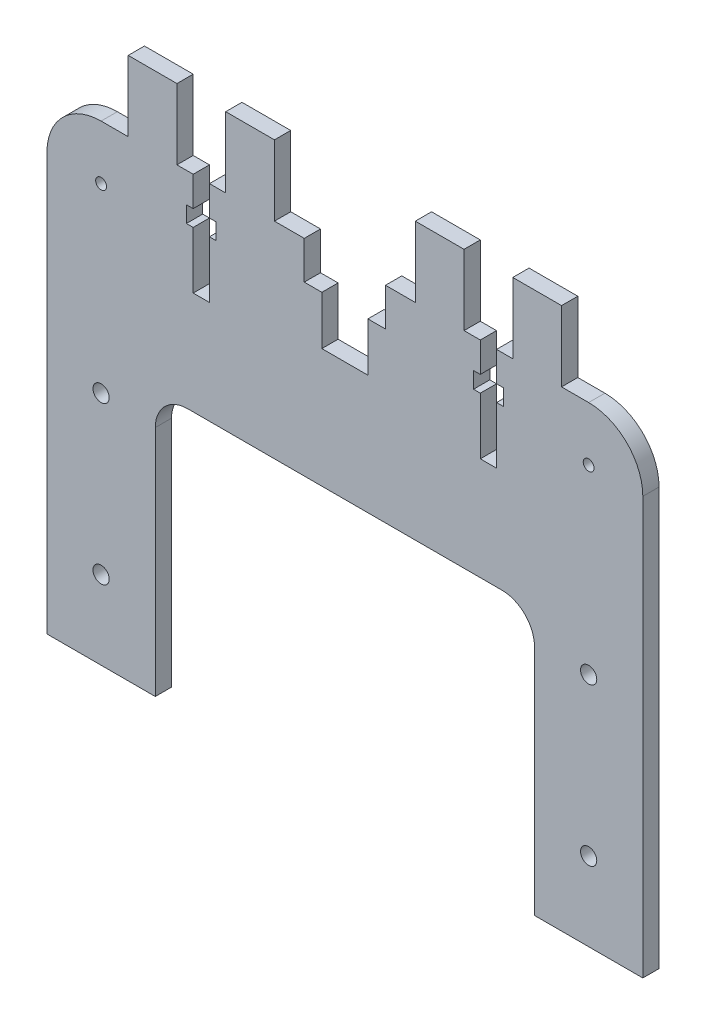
from build123d import *

# Parameters (mm, degrees)
SKETCH1_W           = 9
SKETCH1_H           = 13
SKETCH1_W_2         = 3.25
SKETCH1_H_2         = 3
SKETCH1_W_3         = 8.5
SKETCH1_H_3         = 2
BOSS_EXTRUDE1_DEPTH = 3
SKETCH2_R           = 1.5
CUT_EXTRUDE1_DEPTH  = 157.493215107
FILLET1_R           = 10
FILLET2_R           = 6
SKETCH3_R           = 1
CUT_EXTRUDE2_DEPTH  = 3


with BuildPart() as part:
    # Sketch1 → Boss-Extrude1 (new body)
    with BuildSketch(Plane.XY):
        Polygon((-24.68702041, 7.372536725), (-39.68702041, 7.372536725), (-48.68702041, 7.372536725), (-51.68702041, 7.372536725), (-51.68702041, 1.872536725), (-50.43702041, 1.872536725), (-50.43702041, -1.127463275), (-51.68702041, -1.127463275), (-51.68702041, -11.627463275), (-54.68702041, -11.627463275), (-54.68702041, -1.127463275), (-55.93702041, -1.127463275), (-55.93702041, 1.872536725), (-54.68702041, 1.872536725), (-54.68702041, 7.372536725), (-57.68702041, 7.372536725), (-66.68702041, 7.372536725), (-72.18702041, 7.372536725), (-72.18702041, 0.372536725), (-72.18702041, -2.627463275), (-75.43702041, -2.627463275), (-75.43702041, -8.627463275), (-75.43702041, -10.627463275), (-83.93702041, -10.627463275), (-83.93702041, -8.627463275), (-83.93702041, -2.627463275), (-87.18702041, -2.627463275), (-87.18702041, 0.372536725), (-87.18702041, 7.372536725), (-92.68702041, 7.372536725), (-101.68702041, 7.372536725), (-104.68702041, 7.372536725), (-104.68702041, 1.872536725), (-103.43702041, 1.872536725), (-103.43702041, -1.127463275), (-104.68702041, -1.127463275), (-104.68702041, -11.627463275), (-107.68702041, -11.627463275), (-107.68702041, -1.127463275), (-108.93702041, -1.127463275), (-108.93702041, 1.872536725), (-107.68702041, 1.872536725), (-107.68702041, 7.372536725), (-110.68702041, 7.372536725), (-119.68702041, 7.372536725), (-134.68702041, 7.372536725), (-134.68702041, -79.627463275), (-114.68702041, -79.627463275), (-114.68702041, -30.627463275), (-44.68702041, -30.627463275), (-44.68702041, -79.627463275), (-24.68702041, -79.627463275), align=None)
        with Locations((-97.18702041, 13.872536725)):
            Rectangle(SKETCH1_W, SKETCH1_H)
        with Locations((-115.18702041, 13.872536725)):
            Rectangle(SKETCH1_W, SKETCH1_H)
        with Locations((-62.18702041, 13.872536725)):
            Rectangle(SKETCH1_W, SKETCH1_H)
        with Locations((-44.18702041, 13.872536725)):
            Rectangle(SKETCH1_W, SKETCH1_H)
        with Locations((-85.56202041, -1.127463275)):
            Rectangle(SKETCH1_W_2, SKETCH1_H_2)
        with Locations((-73.81202041, -1.127463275)):
            Rectangle(SKETCH1_W_2, SKETCH1_H_2)
        with Locations((-79.68702041, -9.627463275)):
            Rectangle(SKETCH1_W_3, SKETCH1_H_3)
    extrude(amount=BOSS_EXTRUDE1_DEPTH)

    # Sketch2 → Cut-Extrude1 (cut, through all)
    with BuildSketch(Plane.XY.offset(3)):
        with Locations((-124.68702041, -65.127463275)):
            Circle(SKETCH2_R)
        with Locations((-124.68702041, -36.127463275)):
            Circle(SKETCH2_R)
        with Locations((-34.68702041, -36.127463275)):
            Circle(SKETCH2_R)
        with Locations((-34.68702041, -65.127463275)):
            Circle(SKETCH2_R)
    extrude(amount=-CUT_EXTRUDE1_DEPTH, mode=Mode.SUBTRACT)

    # Fillet1
    fillet1_edges = [part.edges().sort_by_distance(p)[0] for p in [
        (-134.68702041, 7.372536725, 1.5),
        (-24.68702041, 7.372536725, 1.5),
    ]]
    fillet(fillet1_edges, radius=FILLET1_R)

    # Fillet2
    fillet2_edges = [part.edges().sort_by_distance(p)[0] for p in [
        (-44.68702041, -30.627463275, 1.5),
        (-114.68702041, -30.627463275, 1.5),
    ]]
    fillet(fillet2_edges, radius=FILLET2_R)

    # Sketch3 → Cut-Extrude2 (cut)
    with BuildSketch(Plane.XY.offset(3)):
        with Locations((-124.68702041, -2.627463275)):
            Circle(SKETCH3_R)
        with Locations((-34.68702041, -2.627463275)):
            Circle(SKETCH3_R)
    extrude(amount=-CUT_EXTRUDE2_DEPTH, mode=Mode.SUBTRACT)


solid = part.part
